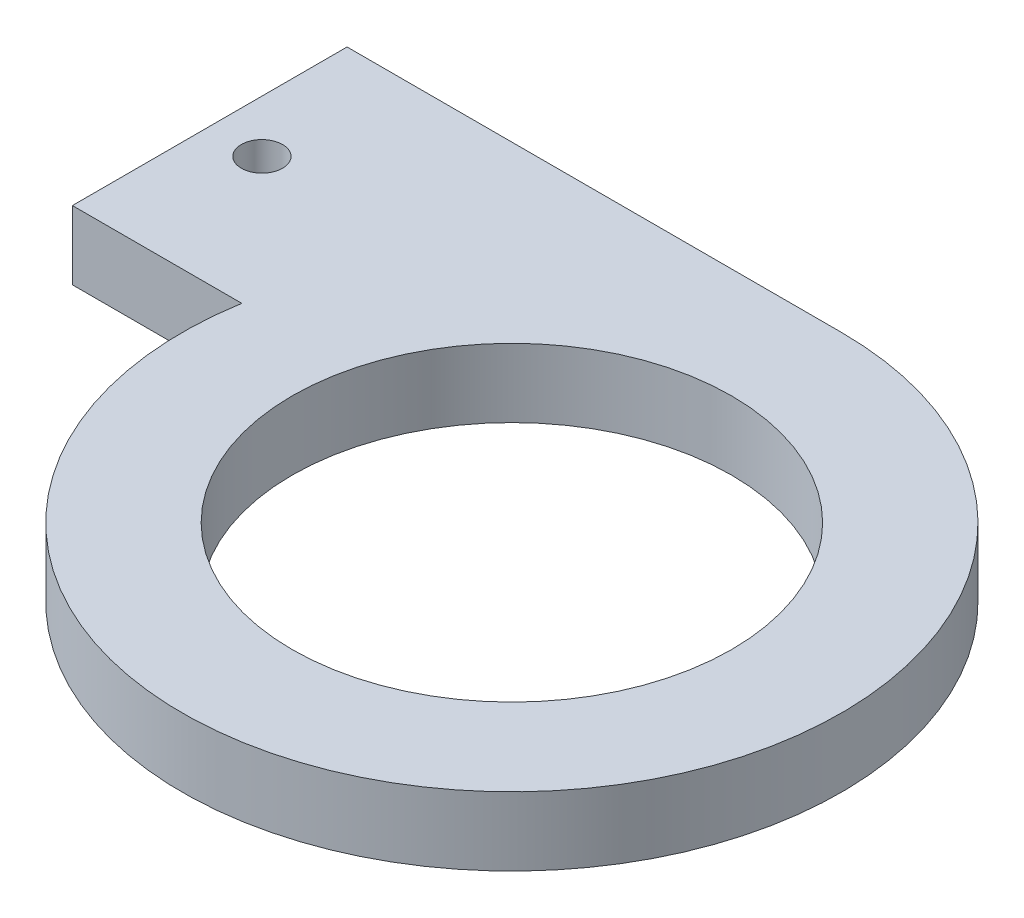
from build123d import *

# Parameters (mm, degrees)
SKETCH2_R           = 1.5
SKETCH2_R_2         = 24
SKETCH2_R_3         = 16
BOSS_EXTRUDE1_DEPTH = 5


with BuildPart() as part:
    # Sketch2 → Boss-Extrude1 (new body)
    # profile 1 of 2: a face of its own
    with BuildSketch(Plane(origin=(0, 0, 0), x_dir=(1, 0, 0), z_dir=(0, 1, 0))):
        with BuildLine():
            ThreePointArc((-23.664319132, 4), (-15.491933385, 18.33030278), (0, 24))
            Line((0, 24), (-36, 24))
            Line((-36, 24), (-36, 4))
            Line((-36, 4), (-23.664319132, 4))
        make_face()
        with Locations(Location((-32.2, 14, 0), (0, 0, 270))):
            Circle(SKETCH2_R, mode=Mode.SUBTRACT)
    # profile 2 of 2: a face of its own
    with BuildSketch(Plane(origin=(0, 0, 0), x_dir=(1, 0, 0), z_dir=(0, 1, 0))):
        Circle(SKETCH2_R_2)
        with Locations(Location((0, 0, 0), (0, 0, 270))):
            Circle(SKETCH2_R_3, mode=Mode.SUBTRACT)
    extrude(amount=BOSS_EXTRUDE1_DEPTH)


solid = part.part
